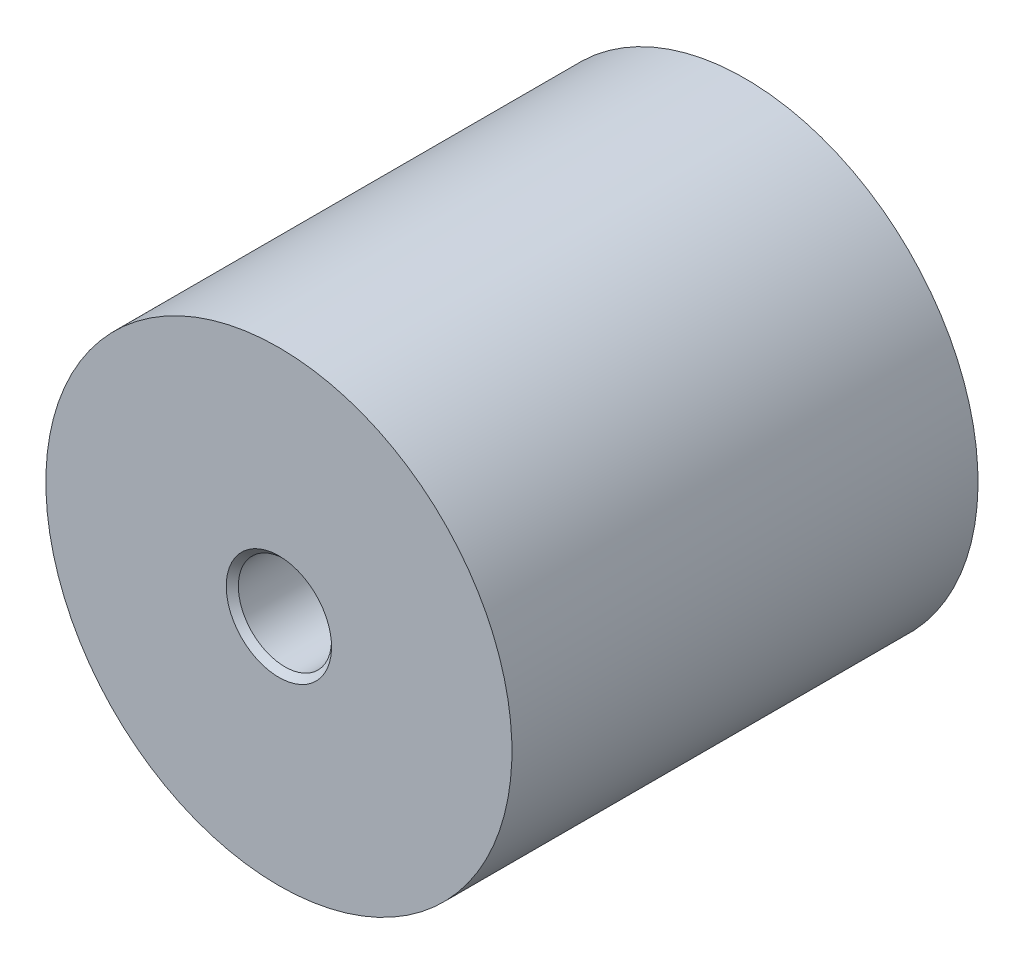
ISO-10303-21;
HEADER;
FILE_DESCRIPTION(('STEP AP214'),'2;1');
FILE_NAME('part.step','',(''),(''),'','','');
FILE_SCHEMA(('AUTOMOTIVE_DESIGN { 1 0 10303 214 1 1 1 1 }'));
ENDSEC;
DATA;
#1=APPLICATION_CONTEXT('core data for automotive mechanical design processes');
#2=APPLICATION_PROTOCOL_DEFINITION('international standard','automotive_design',2000,#1);
#3=PRODUCT_CONTEXT('',#1,'mechanical');
#4=PRODUCT('Part','Part','',(#3));
#5=PRODUCT_RELATED_PRODUCT_CATEGORY('part','',(#4));
#6=PRODUCT_DEFINITION_FORMATION('','',#4);
#7=PRODUCT_DEFINITION_CONTEXT('part definition',#1,'design');
#8=PRODUCT_DEFINITION('design','',#6,#7);
#9=PRODUCT_DEFINITION_SHAPE('','',#8);
#10=(LENGTH_UNIT() NAMED_UNIT(*) SI_UNIT(.MILLI.,.METRE.));
#11=(NAMED_UNIT(*) PLANE_ANGLE_UNIT() SI_UNIT($,.RADIAN.));
#12=(NAMED_UNIT(*) SI_UNIT($,.STERADIAN.) SOLID_ANGLE_UNIT());
#13=UNCERTAINTY_MEASURE_WITH_UNIT(LENGTH_MEASURE(1.E-05),#10,'distance_accuracy_value','');
#14=(GEOMETRIC_REPRESENTATION_CONTEXT(3) GLOBAL_UNCERTAINTY_ASSIGNED_CONTEXT((#13)) GLOBAL_UNIT_ASSIGNED_CONTEXT((#10,
#11,#12)) REPRESENTATION_CONTEXT('',''));
#15=CARTESIAN_POINT('',(0.,0.,0.));
#16=DIRECTION('',(0.,0.,1.));
#17=DIRECTION('',(1.,0.,0.));
#18=AXIS2_PLACEMENT_3D('',#15,#16,#17);
#19=CARTESIAN_POINT('',(0.,0.,1.));
#20=DIRECTION('',(0.,0.,1.));
#21=DIRECTION('',(0.,-1.,0.));
#22=AXIS2_PLACEMENT_3D('',#19,#20,#21);
#23=CYLINDRICAL_SURFACE('',#22,25.);
#24=CARTESIAN_POINT('',(0.,0.,0.));
#25=DIRECTION('',(0.,0.,1.));
#26=DIRECTION('',(0.,-1.,0.));
#27=AXIS2_PLACEMENT_3D('',#24,#25,#26);
#28=CIRCLE('',#27,25.);
#29=CARTESIAN_POINT('',(0.,-25.,0.));
#30=VERTEX_POINT('',#29);
#31=EDGE_CURVE('E23',#30,#30,#28,.T.);
#32=ORIENTED_EDGE('',*,*,#31,.T.);
#33=EDGE_LOOP('',(#32));
#34=FACE_BOUND('',#33,.T.);
#35=CARTESIAN_POINT('',(0.,0.,50.));
#36=DIRECTION('',(0.,0.,-1.));
#37=DIRECTION('',(0.,1.,0.));
#38=AXIS2_PLACEMENT_3D('',#35,#36,#37);
#39=CIRCLE('',#38,25.);
#40=CARTESIAN_POINT('',(0.,25.,50.));
#41=VERTEX_POINT('',#40);
#42=EDGE_CURVE('E32',#41,#41,#39,.T.);
#43=ORIENTED_EDGE('',*,*,#42,.T.);
#44=EDGE_LOOP('',(#43));
#45=FACE_BOUND('',#44,.T.);
#46=ADVANCED_FACE('F12',(#34,#45),#23,.T.);
#47=CARTESIAN_POINT('',(25.,0.,0.));
#48=DIRECTION('',(0.,0.,-1.));
#49=DIRECTION('',(0.,1.,0.));
#50=AXIS2_PLACEMENT_3D('',#47,#48,#49);
#51=PLANE('',#50);
#52=CARTESIAN_POINT('',(0.,0.,0.));
#53=DIRECTION('',(0.,0.,-1.));
#54=DIRECTION('',(0.,1.,0.));
#55=AXIS2_PLACEMENT_3D('',#52,#53,#54);
#56=CIRCLE('',#55,5.65);
#57=CARTESIAN_POINT('',(0.,5.65,0.));
#58=VERTEX_POINT('',#57);
#59=EDGE_CURVE('E8',#58,#58,#56,.F.);
#60=ORIENTED_EDGE('',*,*,#59,.T.);
#61=EDGE_LOOP('',(#60));
#62=FACE_BOUND('',#61,.T.);
#63=ORIENTED_EDGE('',*,*,#31,.F.);
#64=EDGE_LOOP('',(#63));
#65=FACE_BOUND('',#64,.T.);
#66=ADVANCED_FACE('F58',(#62,#65),#51,.T.);
#67=CARTESIAN_POINT('',(0.,0.,0.));
#68=DIRECTION('',(0.,0.,1.));
#69=DIRECTION('',(0.,-1.,0.));
#70=AXIS2_PLACEMENT_3D('',#67,#68,#69);
#71=CYLINDRICAL_SURFACE('',#70,5.);
#72=CARTESIAN_POINT('',(0.,0.,0.65));
#73=DIRECTION('',(0.,0.,-1.));
#74=DIRECTION('',(0.,1.,0.));
#75=AXIS2_PLACEMENT_3D('',#72,#73,#74);
#76=CIRCLE('',#75,5.);
#77=CARTESIAN_POINT('',(0.,5.,0.65));
#78=VERTEX_POINT('',#77);
#79=EDGE_CURVE('E19',#78,#78,#76,.T.);
#80=ORIENTED_EDGE('',*,*,#79,.T.);
#81=EDGE_LOOP('',(#80));
#82=FACE_BOUND('',#81,.T.);
#83=CARTESIAN_POINT('',(0.,0.,10.));
#84=DIRECTION('',(0.,0.,-1.));
#85=DIRECTION('',(0.,1.,0.));
#86=AXIS2_PLACEMENT_3D('',#83,#84,#85);
#87=CIRCLE('',#86,5.);
#88=CARTESIAN_POINT('',(0.,5.,10.));
#89=VERTEX_POINT('',#88);
#90=EDGE_CURVE('E27',#89,#89,#87,.T.);
#91=ORIENTED_EDGE('',*,*,#90,.F.);
#92=EDGE_LOOP('',(#91));
#93=FACE_BOUND('',#92,.T.);
#94=ADVANCED_FACE('F63',(#82,#93),#71,.F.);
#95=CARTESIAN_POINT('',(0.,0.,10.));
#96=DIRECTION('',(0.,0.,-1.));
#97=DIRECTION('',(0.,1.,0.));
#98=AXIS2_PLACEMENT_3D('',#95,#96,#97);
#99=PLANE('',#98);
#100=ORIENTED_EDGE('',*,*,#90,.T.);
#101=EDGE_LOOP('',(#100));
#102=FACE_BOUND('',#101,.T.);
#103=ADVANCED_FACE('F69',(#102),#99,.T.);
#104=CARTESIAN_POINT('',(0.,0.,0.65));
#105=DIRECTION('',(0.,0.,-1.));
#106=DIRECTION('',(0.,1.,0.));
#107=AXIS2_PLACEMENT_3D('',#104,#105,#106);
#108=CONICAL_SURFACE('',#107,5.,0.785398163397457);
#109=ORIENTED_EDGE('',*,*,#59,.F.);
#110=EDGE_LOOP('',(#109));
#111=FACE_BOUND('',#110,.T.);
#112=ORIENTED_EDGE('',*,*,#79,.F.);
#113=EDGE_LOOP('',(#112));
#114=FACE_BOUND('',#113,.T.);
#115=ADVANCED_FACE('F14',(#111,#114),#108,.F.);
#116=CARTESIAN_POINT('',(25.,0.,50.));
#117=DIRECTION('',(0.,0.,1.));
#118=DIRECTION('',(0.,-1.,0.));
#119=AXIS2_PLACEMENT_3D('',#116,#117,#118);
#120=PLANE('',#119);
#121=CARTESIAN_POINT('',(0.,0.,50.));
#122=DIRECTION('',(0.,0.,-1.));
#123=DIRECTION('',(0.,1.,0.));
#124=AXIS2_PLACEMENT_3D('',#121,#122,#123);
#125=CIRCLE('',#124,5.65);
#126=CARTESIAN_POINT('',(0.,5.65,50.));
#127=VERTEX_POINT('',#126);
#128=EDGE_CURVE('E35',#127,#127,#125,.T.);
#129=ORIENTED_EDGE('',*,*,#128,.T.);
#130=EDGE_LOOP('',(#129));
#131=FACE_BOUND('',#130,.T.);
#132=ORIENTED_EDGE('',*,*,#42,.F.);
#133=EDGE_LOOP('',(#132));
#134=FACE_BOUND('',#133,.T.);
#135=ADVANCED_FACE('F73',(#131,#134),#120,.T.);
#136=CARTESIAN_POINT('',(0.,0.,50.));
#137=DIRECTION('',(0.,0.,1.));
#138=DIRECTION('',(0.,-1.,0.));
#139=AXIS2_PLACEMENT_3D('',#136,#137,#138);
#140=CONICAL_SURFACE('',#139,5.65,0.785398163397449);
#141=CARTESIAN_POINT('',(0.,0.,49.35));
#142=DIRECTION('',(0.,0.,-1.));
#143=DIRECTION('',(0.,1.,0.));
#144=AXIS2_PLACEMENT_3D('',#141,#142,#143);
#145=CIRCLE('',#144,5.);
#146=CARTESIAN_POINT('',(0.,5.,49.35));
#147=VERTEX_POINT('',#146);
#148=EDGE_CURVE('E38',#147,#147,#145,.T.);
#149=ORIENTED_EDGE('',*,*,#148,.T.);
#150=EDGE_LOOP('',(#149));
#151=FACE_BOUND('',#150,.T.);
#152=ORIENTED_EDGE('',*,*,#128,.F.);
#153=EDGE_LOOP('',(#152));
#154=FACE_BOUND('',#153,.T.);
#155=ADVANCED_FACE('F55',(#151,#154),#140,.F.);
#156=CARTESIAN_POINT('',(0.,0.,0.));
#157=DIRECTION('',(0.,0.,-1.));
#158=DIRECTION('',(0.,1.,0.));
#159=AXIS2_PLACEMENT_3D('',#156,#157,#158);
#160=CYLINDRICAL_SURFACE('',#159,5.);
#161=CARTESIAN_POINT('',(0.,0.,40.));
#162=DIRECTION('',(0.,0.,-1.));
#163=DIRECTION('',(0.,1.,0.));
#164=AXIS2_PLACEMENT_3D('',#161,#162,#163);
#165=CIRCLE('',#164,5.);
#166=CARTESIAN_POINT('',(0.,5.,40.));
#167=VERTEX_POINT('',#166);
#168=EDGE_CURVE('E41',#167,#167,#165,.T.);
#169=ORIENTED_EDGE('',*,*,#168,.T.);
#170=EDGE_LOOP('',(#169));
#171=FACE_BOUND('',#170,.T.);
#172=ORIENTED_EDGE('',*,*,#148,.F.);
#173=EDGE_LOOP('',(#172));
#174=FACE_BOUND('',#173,.T.);
#175=ADVANCED_FACE('F45',(#171,#174),#160,.F.);
#176=CARTESIAN_POINT('',(5.,0.,40.));
#177=DIRECTION('',(0.,0.,1.));
#178=DIRECTION('',(0.,-1.,0.));
#179=AXIS2_PLACEMENT_3D('',#176,#177,#178);
#180=PLANE('',#179);
#181=ORIENTED_EDGE('',*,*,#168,.F.);
#182=EDGE_LOOP('',(#181));
#183=FACE_BOUND('',#182,.T.);
#184=ADVANCED_FACE('F48',(#183),#180,.T.);
#185=CLOSED_SHELL('',(#46,#66,#94,#103,#115,#135,#155,#175,#184));
#186=MANIFOLD_SOLID_BREP('B1',#185);
#187=ADVANCED_BREP_SHAPE_REPRESENTATION('',(#18,#186),#14);
#188=SHAPE_DEFINITION_REPRESENTATION(#9,#187);
ENDSEC;
END-ISO-10303-21;
